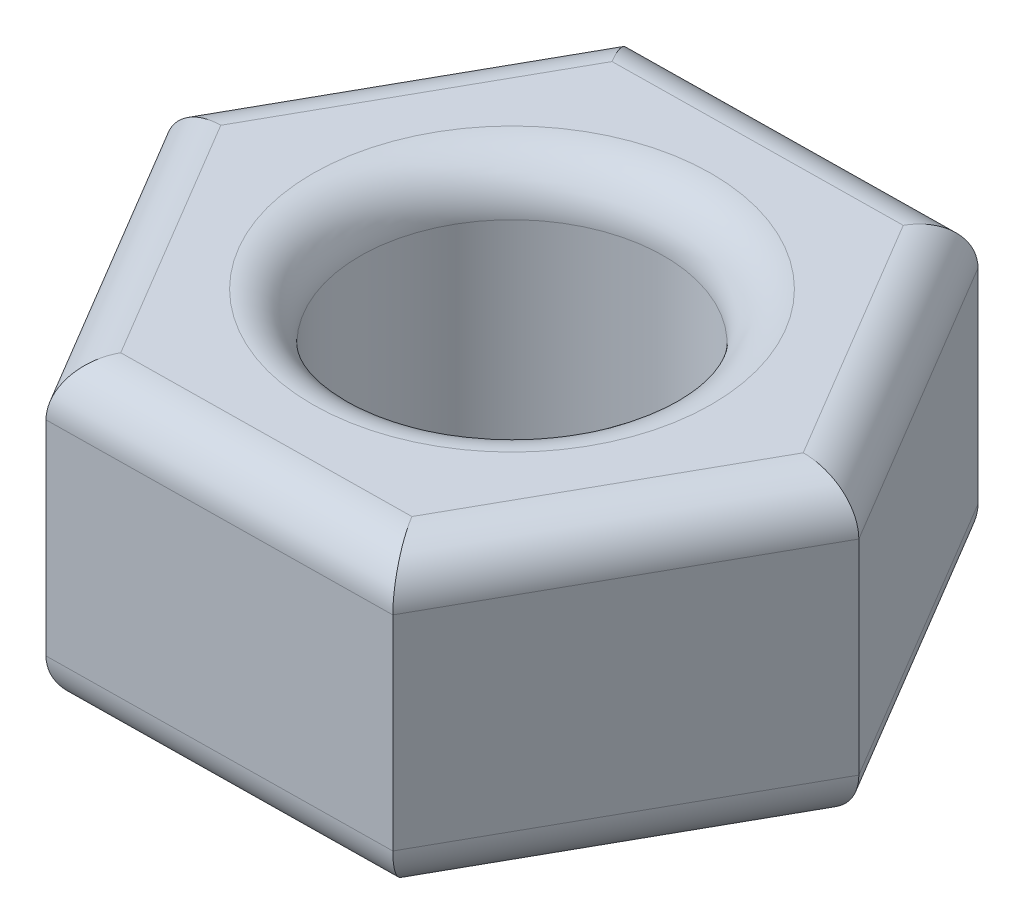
from build123d import *

# Parameters (mm, degrees)
SKETCH1_R           = 3.2
BOSS_EXTRUDE1_DEPTH = 6.3
FILLET1_R           = 1


with BuildPart() as part:
    # Sketch1 → Boss-Extrude1 (new body)
    with BuildSketch(Plane(origin=(0, 0, 0), x_dir=(1, 0, 0), z_dir=(0, 1, 0))):
        Polygon((-3.681439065, 6.187649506), (-7.199381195, -0.094395), (-3.517942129, -6.282044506), (3.681439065, -6.187649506), (7.199381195, 0.094395), (3.517942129, 6.282044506), align=None)
        with Locations(Location((0, 0, 0), (0, 0, 270))):
            Circle(SKETCH1_R, mode=Mode.SUBTRACT)
    extrude(amount=BOSS_EXTRUDE1_DEPTH)

    # Fillet1
    fillet1_edges = [part.edges().sort_by_distance(p)[0] for p in [
        (-5.358661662, 6.3, 3.188219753),
        (0.081748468, 6.3, 6.234847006),
        (5.44041013, 6.3, 3.046627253),
        (0, 0, -3.2),
        (0, 6.3, -3.2),
        (5.358661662, 6.3, -3.188219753),
        (-0.081748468, 6.3, -6.234847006),
        (5.358661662, 0, -3.188219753),
        (5.44041013, 0, 3.046627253),
        (0.081748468, 0, 6.234847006),
        (-5.44041013, 6.3, -3.046627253),
        (-5.358661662, 0, 3.188219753),
        (-5.44041013, 0, -3.046627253),
        (-0.081748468, 0, -6.234847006),
    ]]
    fillet(fillet1_edges, radius=FILLET1_R)


solid = part.part
